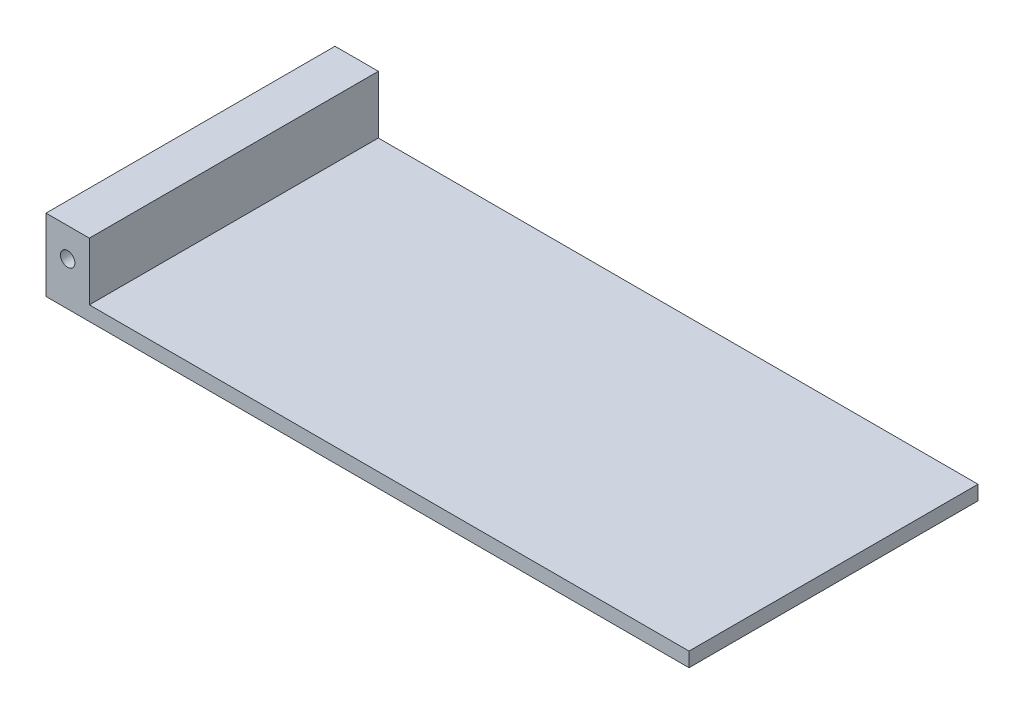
from build123d import *

# Parameters (mm, degrees)
SKETCH1_W          = 565.15
SKETCH1_H          = 12.7
EXTRUDE1_DEPTH     = 254
SKETCH7_W          = 38.1
SKETCH7_H          = 254
EXTRUDE4_DEPTH     = 50.8
SKETCH8_R          = 6.35
CUT_EXTRUDE5_DEPTH = 623.850521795


with BuildPart() as part:
    # Sketch1 → Extrude1 (new body)
    with BuildSketch(Plane.XY):
        with Locations((282.575, 6.35)):
            Rectangle(SKETCH1_W, SKETCH1_H)
    extrude(amount=EXTRUDE1_DEPTH)

    # Sketch7 → Extrude4 (add)
    with BuildSketch(Plane(origin=(0, 12.7, 0), x_dir=(-1, 0, 0), z_dir=(0, 1, 0))):
        with Locations((-19.05, 127)):
            Rectangle(SKETCH7_W, SKETCH7_H)
    extrude(amount=EXTRUDE4_DEPTH)

    # Sketch8 → Cut-Extrude5 (cut, through all)
    with BuildSketch(Plane.XY.offset(254)):
        with Locations((19.05, 38.1)):
            Circle(SKETCH8_R)
    extrude(amount=-CUT_EXTRUDE5_DEPTH, mode=Mode.SUBTRACT)


solid = part.part
